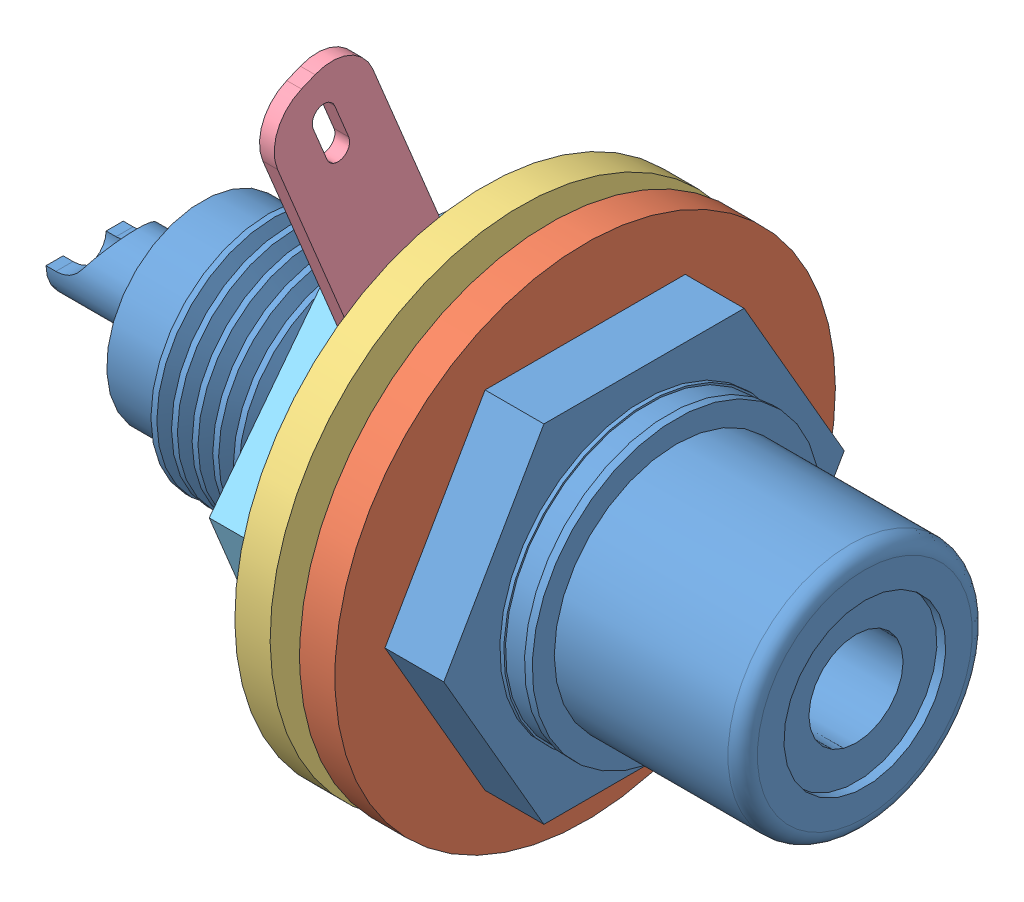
SolidWorks assembly RCA_chassis.SLDASM, configuration Default (file format 4400). Lengths in mm.
Overall size (26.5 26.22 20.93).
5 component instances, 5 part files, 8 mates.
Components (placement in the parent):
- RCA R-1: RCA R.SLDPRT [Default] at (9.0406 1.137 -0.2197) size (26.5 11.78 13.6)
- RCA izolator R-1: RCA izolator R.SLDPRT [Default] at (0.7026 1.137 -0.2197) x (0 0 1) z (-1 0 0) size (17 17 1.2)
- RCA izolator L-1: RCA izolator L.SLDPRT [Default] at (-2.6974 1.137 -0.2197) x (0 -0.108979 -0.994044) z (1 0 0) size (17 17 2.2)
- RCA usica-1: RCA usica.SLDPRT [Default] at (-3.1974 1.137 -0.2197) x (0 0.924225 0.381849) z (1 0 0) size (21.74 12 0.5)
- RCA matica-1: RCA matica.SLDPRT [Default] at (-5.1974 1.137 -0.2197) x (0 0.924225 0.381849) z (1 0 0) size (13.86 12 2)
Mates (geometry in assembly coordinates):
- Coincident1: coincident anti-aligned: plane of RCA R-1 through (0.7026 -21.1946 -0.2197) normal (-1 0 0); plane of RCA izolator R-1 through (0.7026 1.137 -0.2197) normal (1 0 0)
- Concentric1: concentric anti-aligned: cylinder of RCA R-1 through (-12.2974 1.137 -0.2197) axis (-1 0 0) radius 4; cylinder of RCA izolator R-1 through (-0.4974 1.137 -0.2197) axis (1 0 0) radius 4
- Concentric2: concentric aligned: cylinder of RCA R-1 through (-12.2974 1.137 -0.2197) axis (-1 0 0) radius 3.25; cylinder of RCA izolator L-1 through (-2.4974 1.137 -0.2197) axis (-1 0 0) radius 4
- Concentric3: concentric aligned: cylinder of RCA R-1 through (-12.2974 1.137 -0.2197) axis (-1 0 0) radius 3.25; cylinder of RCA usica-1 through (-3.6974 1.137 -0.2197) axis (-1 0 0) radius 4
- Coincident4: coincident anti-aligned: plane of RCA izolator L-1 through (-3.6974 1.137 -0.2197) normal (-1 0 0); plane of RCA usica-1 through (-3.6974 1.137 -0.2197) normal (1 0 0)
- Concentric4: concentric aligned: cylinder of RCA R-1 through (-12.2974 1.137 -0.2197) axis (-1 0 0) radius 3.25; cylinder of RCA matica-1 through (-4.1974 1.137 -0.2197) axis (-1 0 0) radius 4
- Coincident5: coincident anti-aligned: plane of RCA usica-1 through (-4.1974 1.137 -0.2197) normal (-1 0 0); plane of RCA matica-1 through (-4.1974 7.5402 2.4258) normal (1 0 0)
- Coincident6: coincident anti-aligned: plane of RCA izolator R-1 through (-0.4974 1.137 -0.2197) normal (-1 0 0); circle of RCA izolator L-1
